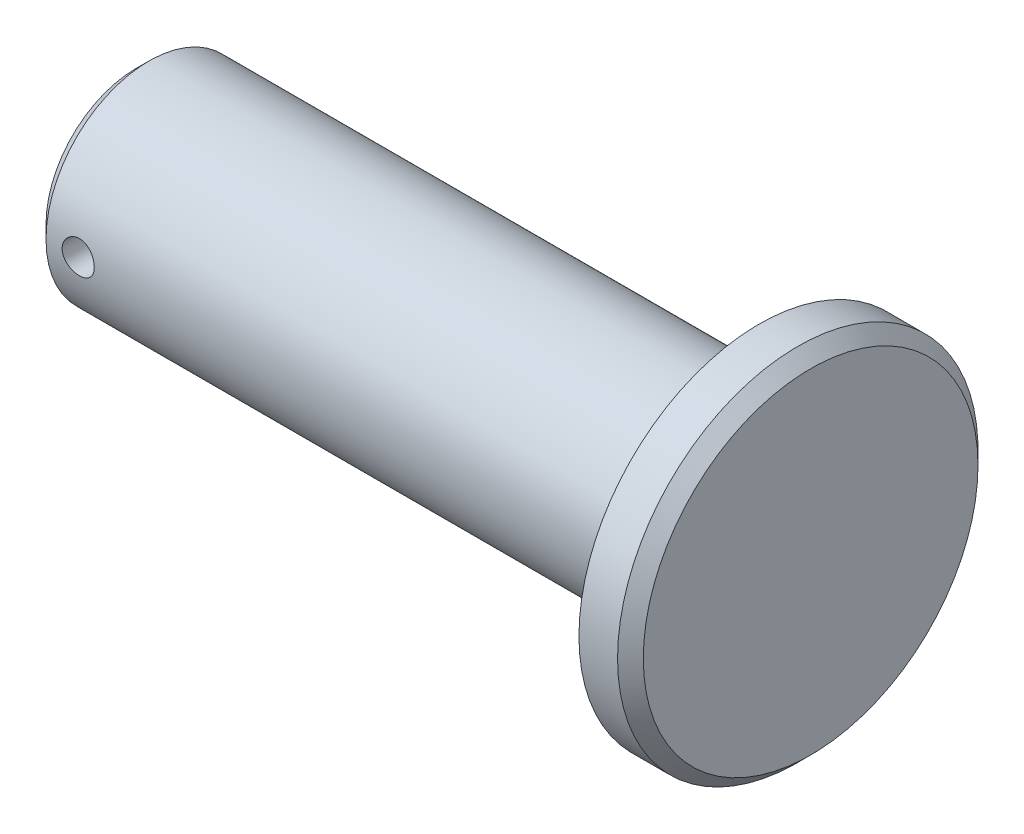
ISO-10303-21;
HEADER;
FILE_DESCRIPTION(('STEP AP214'),'2;1');
FILE_NAME('part.step','',(''),(''),'','','');
FILE_SCHEMA(('AUTOMOTIVE_DESIGN { 1 0 10303 214 1 1 1 1 }'));
ENDSEC;
DATA;
#1=APPLICATION_CONTEXT('core data for automotive mechanical design processes');
#2=APPLICATION_PROTOCOL_DEFINITION('international standard','automotive_design',2000,#1);
#3=PRODUCT_CONTEXT('',#1,'mechanical');
#4=PRODUCT('Part','Part','',(#3));
#5=PRODUCT_RELATED_PRODUCT_CATEGORY('part','',(#4));
#6=PRODUCT_DEFINITION_FORMATION('','',#4);
#7=PRODUCT_DEFINITION_CONTEXT('part definition',#1,'design');
#8=PRODUCT_DEFINITION('design','',#6,#7);
#9=PRODUCT_DEFINITION_SHAPE('','',#8);
#10=(LENGTH_UNIT() NAMED_UNIT(*) SI_UNIT(.MILLI.,.METRE.));
#11=(NAMED_UNIT(*) PLANE_ANGLE_UNIT() SI_UNIT($,.RADIAN.));
#12=(NAMED_UNIT(*) SI_UNIT($,.STERADIAN.) SOLID_ANGLE_UNIT());
#13=UNCERTAINTY_MEASURE_WITH_UNIT(LENGTH_MEASURE(1.E-05),#10,'distance_accuracy_value','');
#14=(GEOMETRIC_REPRESENTATION_CONTEXT(3) GLOBAL_UNCERTAINTY_ASSIGNED_CONTEXT((#13)) GLOBAL_UNIT_ASSIGNED_CONTEXT((#10,
#11,#12)) REPRESENTATION_CONTEXT('',''));
#15=CARTESIAN_POINT('',(0.,0.,0.));
#16=DIRECTION('',(0.,0.,1.));
#17=DIRECTION('',(1.,0.,0.));
#18=AXIS2_PLACEMENT_3D('',#15,#16,#17);
#19=CARTESIAN_POINT('',(-51.4,0.,0.));
#20=DIRECTION('',(1.,0.,0.));
#21=DIRECTION('',(0.,0.,-1.));
#22=AXIS2_PLACEMENT_3D('',#19,#20,#21);
#23=CONICAL_SURFACE('',#22,8.,0.785398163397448);
#24=CARTESIAN_POINT('',(-52.4,0.,0.));
#25=DIRECTION('',(-1.,0.,0.));
#26=DIRECTION('',(0.,0.,1.));
#27=AXIS2_PLACEMENT_3D('',#24,#25,#26);
#28=CIRCLE('',#27,7.);
#29=CARTESIAN_POINT('',(-52.4,0.,7.));
#30=VERTEX_POINT('',#29);
#31=EDGE_CURVE('E86',#30,#30,#28,.T.);
#32=ORIENTED_EDGE('',*,*,#31,.F.);
#33=EDGE_LOOP('',(#32));
#34=FACE_BOUND('',#33,.T.);
#35=CARTESIAN_POINT('',(-51.4,0.,0.));
#36=DIRECTION('',(-1.,0.,0.));
#37=DIRECTION('',(0.,0.,1.));
#38=AXIS2_PLACEMENT_3D('',#35,#36,#37);
#39=CIRCLE('',#38,8.);
#40=CARTESIAN_POINT('',(-51.4,0.,8.));
#41=VERTEX_POINT('',#40);
#42=EDGE_CURVE('E10',#41,#41,#39,.T.);
#43=ORIENTED_EDGE('',*,*,#42,.T.);
#44=EDGE_LOOP('',(#43));
#45=FACE_BOUND('',#44,.T.);
#46=ADVANCED_FACE('F25',(#34,#45),#23,.T.);
#47=CARTESIAN_POINT('',(-61.8887870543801,0.,0.));
#48=DIRECTION('',(-1.,0.,0.));
#49=DIRECTION('',(0.,0.,1.));
#50=AXIS2_PLACEMENT_3D('',#47,#48,#49);
#51=CYLINDRICAL_SURFACE('',#50,8.);
#52=CARTESIAN_POINT('',(-47.65,0.,8.));
#53=CARTESIAN_POINT('',(-47.6500028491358,-0.0697575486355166,7.99999885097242));
#54=CARTESIAN_POINT('',(-47.6558590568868,-0.139554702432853,7.9990780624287));
#55=CARTESIAN_POINT('',(-47.6791218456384,-0.277195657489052,7.99549349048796));
#56=CARTESIAN_POINT('',(-47.6965394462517,-0.34503753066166,7.99282804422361));
#57=CARTESIAN_POINT('',(-47.7423898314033,-0.476756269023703,7.98605348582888));
#58=CARTESIAN_POINT('',(-47.7708140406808,-0.540636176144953,7.98194549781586));
#59=CARTESIAN_POINT('',(-47.8378492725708,-0.662710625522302,7.97273897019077));
#60=CARTESIAN_POINT('',(-47.876458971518,-0.720905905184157,7.96764055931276));
#61=CARTESIAN_POINT('',(-47.963116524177,-0.830459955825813,7.95697134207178));
#62=CARTESIAN_POINT('',(-48.0112334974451,-0.881763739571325,7.95139725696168));
#63=CARTESIAN_POINT('',(-48.1153909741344,-0.975603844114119,7.94043038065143));
#64=CARTESIAN_POINT('',(-48.1714319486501,-1.01813964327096,7.93503760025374));
#65=CARTESIAN_POINT('',(-48.2902191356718,-1.09345272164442,7.92501214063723));
#66=CARTESIAN_POINT('',(-48.3529997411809,-1.12617636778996,7.92038369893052));
#67=CARTESIAN_POINT('',(-48.4832507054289,-1.18059340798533,7.91245600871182));
#68=CARTESIAN_POINT('',(-48.5507207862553,-1.20228745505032,7.90915668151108));
#69=CARTESIAN_POINT('',(-48.6878554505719,-1.23385779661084,7.90429317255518));
#70=CARTESIAN_POINT('',(-48.7574977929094,-1.24382852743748,7.90271513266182));
#71=CARTESIAN_POINT('',(-48.8974835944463,-1.25196184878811,7.90143085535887));
#72=CARTESIAN_POINT('',(-48.967827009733,-1.25012517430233,7.90172450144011));
#73=CARTESIAN_POINT('',(-49.1065485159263,-1.23477290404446,7.90413775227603));
#74=CARTESIAN_POINT('',(-49.1749386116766,-1.22136281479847,7.90624086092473));
#75=CARTESIAN_POINT('',(-49.3084860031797,-1.18340968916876,7.91201028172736));
#76=CARTESIAN_POINT('',(-49.3736432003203,-1.15886631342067,7.91567664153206));
#77=CARTESIAN_POINT('',(-49.4991943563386,-1.09923458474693,7.92417753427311));
#78=CARTESIAN_POINT('',(-49.5595668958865,-1.06410186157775,7.92901696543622));
#79=CARTESIAN_POINT('',(-49.6735997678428,-0.984320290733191,7.93931523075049));
#80=CARTESIAN_POINT('',(-49.7272596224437,-0.939670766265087,7.94477410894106));
#81=CARTESIAN_POINT('',(-49.8269551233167,-0.841545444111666,7.95576893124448));
#82=CARTESIAN_POINT('',(-49.8729015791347,-0.787979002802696,7.96130506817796));
#83=CARTESIAN_POINT('',(-49.9551665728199,-0.673848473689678,7.97177562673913));
#84=CARTESIAN_POINT('',(-49.9914850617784,-0.613284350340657,7.97671004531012));
#85=CARTESIAN_POINT('',(-50.0534690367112,-0.486797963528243,7.98542699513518));
#86=CARTESIAN_POINT('',(-50.0791272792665,-0.420872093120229,7.98920874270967));
#87=CARTESIAN_POINT('',(-50.1189829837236,-0.285574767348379,7.99518780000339));
#88=CARTESIAN_POINT('',(-50.1331812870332,-0.2162035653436,7.99738522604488));
#89=CARTESIAN_POINT('',(-50.1495946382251,-0.0767541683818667,7.99993255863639));
#90=CARTESIAN_POINT('',(-50.1519322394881,-0.00669073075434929,8.0003013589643));
#91=CARTESIAN_POINT('',(-50.144883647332,0.132827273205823,7.99920143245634));
#92=CARTESIAN_POINT('',(-50.1354978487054,0.202281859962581,7.99773276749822));
#93=CARTESIAN_POINT('',(-50.1053708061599,0.338236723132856,7.99313461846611));
#94=CARTESIAN_POINT('',(-50.0846896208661,0.404750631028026,7.99001392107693));
#95=CARTESIAN_POINT('',(-50.0326224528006,0.533367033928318,7.98246037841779));
#96=CARTESIAN_POINT('',(-50.0012359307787,0.595469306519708,7.97802746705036));
#97=CARTESIAN_POINT('',(-49.9283640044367,0.714036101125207,7.96829486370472));
#98=CARTESIAN_POINT('',(-49.8868012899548,0.770452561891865,7.9629886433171));
#99=CARTESIAN_POINT('',(-49.7948639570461,0.875553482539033,7.95211940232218));
#100=CARTESIAN_POINT('',(-49.7444887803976,0.924237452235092,7.94655636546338));
#101=CARTESIAN_POINT('',(-49.6358094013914,1.01294040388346,7.93574013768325));
#102=CARTESIAN_POINT('',(-49.5774375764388,1.05287699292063,7.93049020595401));
#103=CARTESIAN_POINT('',(-49.4547419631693,1.12237783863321,7.92095346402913));
#104=CARTESIAN_POINT('',(-49.3904183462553,1.15194239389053,7.91666662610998));
#105=CARTESIAN_POINT('',(-49.2578851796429,1.19973385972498,7.90956535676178));
#106=CARTESIAN_POINT('',(-49.1896912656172,1.21800327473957,7.9067454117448));
#107=CARTESIAN_POINT('',(-49.051155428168,1.24282061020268,7.90288285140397));
#108=CARTESIAN_POINT('',(-48.9808136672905,1.24936941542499,7.9018401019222));
#109=CARTESIAN_POINT('',(-48.8408006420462,1.25053726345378,7.90165529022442));
#110=CARTESIAN_POINT('',(-48.7711304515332,1.24528590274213,7.90249258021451));
#111=CARTESIAN_POINT('',(-48.6336773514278,1.22328111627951,7.90592849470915));
#112=CARTESIAN_POINT('',(-48.5658944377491,1.20652771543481,7.90852711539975));
#113=CARTESIAN_POINT('',(-48.4341810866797,1.16204164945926,7.91518544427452));
#114=CARTESIAN_POINT('',(-48.3702472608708,1.13431880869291,7.91924384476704));
#115=CARTESIAN_POINT('',(-48.2479171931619,1.06869384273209,7.92836592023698));
#116=CARTESIAN_POINT('',(-48.1895211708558,1.03079131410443,7.93342963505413));
#117=CARTESIAN_POINT('',(-48.0792672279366,0.945415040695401,7.9440578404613));
#118=CARTESIAN_POINT('',(-48.0274839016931,0.897845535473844,7.94962700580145));
#119=CARTESIAN_POINT('',(-47.9325893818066,0.794687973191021,7.96060021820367));
#120=CARTESIAN_POINT('',(-47.889480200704,0.739098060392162,7.96600422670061));
#121=CARTESIAN_POINT('',(-47.8129243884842,0.621083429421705,7.9760755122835));
#122=CARTESIAN_POINT('',(-47.7795373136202,0.558619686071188,7.98073817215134));
#123=CARTESIAN_POINT('',(-47.7237795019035,0.428925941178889,7.98875629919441));
#124=CARTESIAN_POINT('',(-47.7013975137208,0.361700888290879,7.9921131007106));
#125=CARTESIAN_POINT('',(-47.6732834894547,0.245157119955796,7.9963872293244));
#126=CARTESIAN_POINT('',(-47.6645657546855,0.196552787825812,7.99773495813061));
#127=CARTESIAN_POINT('',(-47.6529230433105,0.098638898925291,7.99954174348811));
#128=CARTESIAN_POINT('',(-47.6499979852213,0.0493293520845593,8.00000081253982));
#129=CARTESIAN_POINT('',(-47.65,0.,8.));
#130=B_SPLINE_CURVE_WITH_KNOTS('',3,(#52,#53,#54,#55,#56,#57,#58,#59,#60,#61,#62,#63,#64,#65,
#66,#67,#68,#69,#70,#71,#72,#73,#74,#75,#76,#77,#78,#79,#80,#81,#82,#83,#84,#85,#86,#87,#88,#89,
#90,#91,#92,#93,#94,#95,#96,#97,#98,#99,#100,#101,#102,#103,#104,#105,#106,#107,#108,#109,#110,
#111,#112,#113,#114,#115,#116,#117,#118,#119,#120,#121,#122,#123,#124,#125,#126,#127,#128,#129),
.UNSPECIFIED.,.T.,.F.,(4,2,2,2,2,2,2,2,2,2,2,2,2,2,2,2,2,2,2,2,2,2,2,2,2,2,2,2,2,2,2,2,2,2,2,2,
2,2,4),(0.,0.209092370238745,0.418384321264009,0.627513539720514,0.836615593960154,
1.047297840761,1.25799261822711,1.46981889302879,1.6816326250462,1.89172815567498,
2.10181060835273,2.3099978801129,2.51819149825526,2.72726988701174,2.93636314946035,
3.14772866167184,3.35909524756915,3.57060521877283,3.78209965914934,3.99140427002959,
4.2007018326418,4.40889722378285,4.61710310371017,4.82694270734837,5.03679560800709,
5.24854740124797,5.46029309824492,5.67123705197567,5.8821650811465,6.09078790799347,
6.2994102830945,6.50784623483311,6.71629044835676,6.92691006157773,7.13757848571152,
7.34951152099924,7.56122742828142,7.70909008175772,7.85695065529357),.UNSPECIFIED.);
#131=CARTESIAN_POINT('',(-47.65,0.,8.));
#132=VERTEX_POINT('',#131);
#133=EDGE_CURVE('E28',#132,#132,#130,.T.);
#134=ORIENTED_EDGE('',*,*,#133,.T.);
#135=EDGE_LOOP('',(#134));
#136=FACE_BOUND('',#135,.T.);
#137=CARTESIAN_POINT('',(-47.65,0.,-8.));
#138=CARTESIAN_POINT('',(-47.6500028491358,0.0697575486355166,-7.99999885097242));
#139=CARTESIAN_POINT('',(-47.6558590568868,0.139554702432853,-7.9990780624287));
#140=CARTESIAN_POINT('',(-47.6791218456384,0.277195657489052,-7.99549349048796));
#141=CARTESIAN_POINT('',(-47.6965394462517,0.34503753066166,-7.99282804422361));
#142=CARTESIAN_POINT('',(-47.7423898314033,0.476756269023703,-7.98605348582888));
#143=CARTESIAN_POINT('',(-47.7708140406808,0.540636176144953,-7.98194549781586));
#144=CARTESIAN_POINT('',(-47.8378492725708,0.662710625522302,-7.97273897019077));
#145=CARTESIAN_POINT('',(-47.876458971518,0.720905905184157,-7.96764055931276));
#146=CARTESIAN_POINT('',(-47.963116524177,0.830459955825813,-7.95697134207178));
#147=CARTESIAN_POINT('',(-48.0112334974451,0.881763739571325,-7.95139725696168));
#148=CARTESIAN_POINT('',(-48.1153909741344,0.975603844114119,-7.94043038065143));
#149=CARTESIAN_POINT('',(-48.1714319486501,1.01813964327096,-7.93503760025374));
#150=CARTESIAN_POINT('',(-48.2902191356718,1.09345272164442,-7.92501214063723));
#151=CARTESIAN_POINT('',(-48.3529997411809,1.12617636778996,-7.92038369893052));
#152=CARTESIAN_POINT('',(-48.4832507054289,1.18059340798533,-7.91245600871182));
#153=CARTESIAN_POINT('',(-48.5507207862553,1.20228745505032,-7.90915668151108));
#154=CARTESIAN_POINT('',(-48.6878554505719,1.23385779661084,-7.90429317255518));
#155=CARTESIAN_POINT('',(-48.7574977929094,1.24382852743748,-7.90271513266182));
#156=CARTESIAN_POINT('',(-48.8974835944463,1.25196184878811,-7.90143085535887));
#157=CARTESIAN_POINT('',(-48.967827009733,1.25012517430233,-7.90172450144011));
#158=CARTESIAN_POINT('',(-49.1065485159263,1.23477290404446,-7.90413775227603));
#159=CARTESIAN_POINT('',(-49.1749386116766,1.22136281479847,-7.90624086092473));
#160=CARTESIAN_POINT('',(-49.3084860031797,1.18340968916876,-7.91201028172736));
#161=CARTESIAN_POINT('',(-49.3736432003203,1.15886631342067,-7.91567664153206));
#162=CARTESIAN_POINT('',(-49.4991943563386,1.09923458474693,-7.92417753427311));
#163=CARTESIAN_POINT('',(-49.5595668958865,1.06410186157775,-7.92901696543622));
#164=CARTESIAN_POINT('',(-49.6735997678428,0.984320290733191,-7.93931523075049));
#165=CARTESIAN_POINT('',(-49.7272596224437,0.939670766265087,-7.94477410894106));
#166=CARTESIAN_POINT('',(-49.8269551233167,0.841545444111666,-7.95576893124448));
#167=CARTESIAN_POINT('',(-49.8729015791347,0.787979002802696,-7.96130506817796));
#168=CARTESIAN_POINT('',(-49.9551665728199,0.673848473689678,-7.97177562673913));
#169=CARTESIAN_POINT('',(-49.9914850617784,0.613284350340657,-7.97671004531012));
#170=CARTESIAN_POINT('',(-50.0534690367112,0.486797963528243,-7.98542699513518));
#171=CARTESIAN_POINT('',(-50.0791272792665,0.420872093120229,-7.98920874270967));
#172=CARTESIAN_POINT('',(-50.1189829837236,0.285574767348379,-7.99518780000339));
#173=CARTESIAN_POINT('',(-50.1331812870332,0.2162035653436,-7.99738522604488));
#174=CARTESIAN_POINT('',(-50.1495946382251,0.0767541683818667,-7.99993255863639));
#175=CARTESIAN_POINT('',(-50.1519322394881,0.00669073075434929,-8.0003013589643));
#176=CARTESIAN_POINT('',(-50.144883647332,-0.132827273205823,-7.99920143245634));
#177=CARTESIAN_POINT('',(-50.1354978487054,-0.202281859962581,-7.99773276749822));
#178=CARTESIAN_POINT('',(-50.1053708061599,-0.338236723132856,-7.99313461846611));
#179=CARTESIAN_POINT('',(-50.0846896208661,-0.404750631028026,-7.99001392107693));
#180=CARTESIAN_POINT('',(-50.0326224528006,-0.533367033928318,-7.98246037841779));
#181=CARTESIAN_POINT('',(-50.0012359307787,-0.595469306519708,-7.97802746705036));
#182=CARTESIAN_POINT('',(-49.9283640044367,-0.714036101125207,-7.96829486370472));
#183=CARTESIAN_POINT('',(-49.8868012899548,-0.770452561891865,-7.9629886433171));
#184=CARTESIAN_POINT('',(-49.7948639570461,-0.875553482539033,-7.95211940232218));
#185=CARTESIAN_POINT('',(-49.7444887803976,-0.924237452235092,-7.94655636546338));
#186=CARTESIAN_POINT('',(-49.6358094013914,-1.01294040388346,-7.93574013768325));
#187=CARTESIAN_POINT('',(-49.5774375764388,-1.05287699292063,-7.93049020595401));
#188=CARTESIAN_POINT('',(-49.4547419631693,-1.12237783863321,-7.92095346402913));
#189=CARTESIAN_POINT('',(-49.3904183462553,-1.15194239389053,-7.91666662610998));
#190=CARTESIAN_POINT('',(-49.2578851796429,-1.19973385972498,-7.90956535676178));
#191=CARTESIAN_POINT('',(-49.1896912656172,-1.21800327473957,-7.9067454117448));
#192=CARTESIAN_POINT('',(-49.051155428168,-1.24282061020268,-7.90288285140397));
#193=CARTESIAN_POINT('',(-48.9808136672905,-1.24936941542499,-7.9018401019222));
#194=CARTESIAN_POINT('',(-48.8408006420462,-1.25053726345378,-7.90165529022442));
#195=CARTESIAN_POINT('',(-48.7711304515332,-1.24528590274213,-7.90249258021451));
#196=CARTESIAN_POINT('',(-48.6336773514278,-1.22328111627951,-7.90592849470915));
#197=CARTESIAN_POINT('',(-48.5658944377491,-1.20652771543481,-7.90852711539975));
#198=CARTESIAN_POINT('',(-48.4341810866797,-1.16204164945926,-7.91518544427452));
#199=CARTESIAN_POINT('',(-48.3702472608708,-1.13431880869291,-7.91924384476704));
#200=CARTESIAN_POINT('',(-48.2479171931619,-1.06869384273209,-7.92836592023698));
#201=CARTESIAN_POINT('',(-48.1895211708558,-1.03079131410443,-7.93342963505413));
#202=CARTESIAN_POINT('',(-48.0792672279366,-0.945415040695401,-7.9440578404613));
#203=CARTESIAN_POINT('',(-48.0274839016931,-0.897845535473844,-7.94962700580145));
#204=CARTESIAN_POINT('',(-47.9325893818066,-0.794687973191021,-7.96060021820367));
#205=CARTESIAN_POINT('',(-47.889480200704,-0.739098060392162,-7.96600422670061));
#206=CARTESIAN_POINT('',(-47.8129243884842,-0.621083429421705,-7.9760755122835));
#207=CARTESIAN_POINT('',(-47.7795373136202,-0.558619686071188,-7.98073817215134));
#208=CARTESIAN_POINT('',(-47.7237795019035,-0.428925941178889,-7.98875629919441));
#209=CARTESIAN_POINT('',(-47.7013975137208,-0.361700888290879,-7.9921131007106));
#210=CARTESIAN_POINT('',(-47.6732834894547,-0.245157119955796,-7.9963872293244));
#211=CARTESIAN_POINT('',(-47.6645657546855,-0.196552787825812,-7.99773495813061));
#212=CARTESIAN_POINT('',(-47.6529230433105,-0.098638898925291,-7.99954174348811));
#213=CARTESIAN_POINT('',(-47.6499979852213,-0.0493293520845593,-8.00000081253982));
#214=CARTESIAN_POINT('',(-47.65,0.,-8.));
#215=B_SPLINE_CURVE_WITH_KNOTS('',3,(#137,#138,#139,#140,#141,#142,#143,#144,#145,#146,#147,
#148,#149,#150,#151,#152,#153,#154,#155,#156,#157,#158,#159,#160,#161,#162,#163,#164,#165,#166,
#167,#168,#169,#170,#171,#172,#173,#174,#175,#176,#177,#178,#179,#180,#181,#182,#183,#184,#185,
#186,#187,#188,#189,#190,#191,#192,#193,#194,#195,#196,#197,#198,#199,#200,#201,#202,#203,#204,
#205,#206,#207,#208,#209,#210,#211,#212,#213,#214),.UNSPECIFIED.,.T.,.F.,(4,2,2,2,2,2,2,2,2,2,2,
2,2,2,2,2,2,2,2,2,2,2,2,2,2,2,2,2,2,2,2,2,2,2,2,2,2,2,4),(0.,0.209092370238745,
0.418384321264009,0.627513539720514,0.836615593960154,1.047297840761,1.25799261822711,
1.46981889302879,1.6816326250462,1.89172815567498,2.10181060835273,2.3099978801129,
2.51819149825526,2.72726988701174,2.93636314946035,3.14772866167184,3.35909524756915,
3.57060521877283,3.78209965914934,3.99140427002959,4.2007018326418,4.40889722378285,
4.61710310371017,4.82694270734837,5.03679560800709,5.24854740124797,5.46029309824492,
5.67123705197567,5.8821650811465,6.09078790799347,6.2994102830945,6.50784623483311,
6.71629044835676,6.92691006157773,7.13757848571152,7.34951152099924,7.56122742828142,
7.70909008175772,7.85695065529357),.UNSPECIFIED.);
#216=CARTESIAN_POINT('',(-47.65,0.,-8.));
#217=VERTEX_POINT('',#216);
#218=EDGE_CURVE('E43',#217,#217,#215,.T.);
#219=ORIENTED_EDGE('',*,*,#218,.T.);
#220=EDGE_LOOP('',(#219));
#221=FACE_BOUND('',#220,.T.);
#222=ORIENTED_EDGE('',*,*,#42,.F.);
#223=EDGE_LOOP('',(#222));
#224=FACE_BOUND('',#223,.T.);
#225=CARTESIAN_POINT('',(-4.,0.,0.));
#226=DIRECTION('',(-1.,0.,0.));
#227=DIRECTION('',(0.,0.,1.));
#228=AXIS2_PLACEMENT_3D('',#225,#226,#227);
#229=CIRCLE('',#228,8.);
#230=CARTESIAN_POINT('',(-4.,0.,8.));
#231=VERTEX_POINT('',#230);
#232=EDGE_CURVE('E35',#231,#231,#229,.T.);
#233=ORIENTED_EDGE('',*,*,#232,.T.);
#234=EDGE_LOOP('',(#233));
#235=FACE_BOUND('',#234,.T.);
#236=ADVANCED_FACE('F47',(#136,#221,#224,#235),#51,.T.);
#237=CARTESIAN_POINT('',(-4.,8.,0.));
#238=DIRECTION('',(1.,0.,0.));
#239=DIRECTION('',(0.,0.,-1.));
#240=AXIS2_PLACEMENT_3D('',#237,#238,#239);
#241=PLANE('',#240);
#242=ORIENTED_EDGE('',*,*,#232,.F.);
#243=EDGE_LOOP('',(#242));
#244=FACE_BOUND('',#243,.T.);
#245=CARTESIAN_POINT('',(-4.,0.,0.));
#246=DIRECTION('',(-1.,0.,0.));
#247=DIRECTION('',(0.,0.,1.));
#248=AXIS2_PLACEMENT_3D('',#245,#246,#247);
#249=CIRCLE('',#248,14.);
#250=CARTESIAN_POINT('',(-4.,0.,14.));
#251=VERTEX_POINT('',#250);
#252=EDGE_CURVE('E40',#251,#251,#249,.T.);
#253=ORIENTED_EDGE('',*,*,#252,.T.);
#254=EDGE_LOOP('',(#253));
#255=FACE_BOUND('',#254,.T.);
#256=ADVANCED_FACE('F70',(#244,#255),#241,.F.);
#257=CARTESIAN_POINT('',(-61.8887870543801,0.,0.));
#258=DIRECTION('',(-1.,0.,0.));
#259=DIRECTION('',(0.,0.,1.));
#260=AXIS2_PLACEMENT_3D('',#257,#258,#259);
#261=CYLINDRICAL_SURFACE('',#260,14.);
#262=ORIENTED_EDGE('',*,*,#252,.F.);
#263=EDGE_LOOP('',(#262));
#264=FACE_BOUND('',#263,.T.);
#265=CARTESIAN_POINT('',(-1.,0.,0.));
#266=DIRECTION('',(-1.,0.,0.));
#267=DIRECTION('',(0.,0.,1.));
#268=AXIS2_PLACEMENT_3D('',#265,#266,#267);
#269=CIRCLE('',#268,14.);
#270=CARTESIAN_POINT('',(-1.,0.,14.));
#271=VERTEX_POINT('',#270);
#272=EDGE_CURVE('E90',#271,#271,#269,.T.);
#273=ORIENTED_EDGE('',*,*,#272,.T.);
#274=EDGE_LOOP('',(#273));
#275=FACE_BOUND('',#274,.T.);
#276=ADVANCED_FACE('F67',(#264,#275),#261,.T.);
#277=CARTESIAN_POINT('',(0.,0.,0.));
#278=DIRECTION('',(-1.,0.,0.));
#279=DIRECTION('',(0.,0.,1.));
#280=AXIS2_PLACEMENT_3D('',#277,#278,#279);
#281=CONICAL_SURFACE('',#280,13.,0.785398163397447);
#282=ORIENTED_EDGE('',*,*,#272,.F.);
#283=EDGE_LOOP('',(#282));
#284=FACE_BOUND('',#283,.T.);
#285=CARTESIAN_POINT('',(0.,0.,0.));
#286=DIRECTION('',(-1.,0.,0.));
#287=DIRECTION('',(0.,0.,1.));
#288=AXIS2_PLACEMENT_3D('',#285,#286,#287);
#289=CIRCLE('',#288,13.);
#290=CARTESIAN_POINT('',(0.,0.,13.));
#291=VERTEX_POINT('',#290);
#292=EDGE_CURVE('E87',#291,#291,#289,.T.);
#293=ORIENTED_EDGE('',*,*,#292,.T.);
#294=EDGE_LOOP('',(#293));
#295=FACE_BOUND('',#294,.T.);
#296=ADVANCED_FACE('F63',(#284,#295),#281,.T.);
#297=CARTESIAN_POINT('',(0.,13.,0.));
#298=DIRECTION('',(-1.,0.,0.));
#299=DIRECTION('',(0.,0.,1.));
#300=AXIS2_PLACEMENT_3D('',#297,#298,#299);
#301=PLANE('',#300);
#302=ORIENTED_EDGE('',*,*,#292,.F.);
#303=EDGE_LOOP('',(#302));
#304=FACE_BOUND('',#303,.T.);
#305=ADVANCED_FACE('F59',(#304),#301,.F.);
#306=CARTESIAN_POINT('',(-52.4,0.,0.));
#307=DIRECTION('',(1.,0.,0.));
#308=DIRECTION('',(0.,0.,-1.));
#309=AXIS2_PLACEMENT_3D('',#306,#307,#308);
#310=PLANE('',#309);
#311=ORIENTED_EDGE('',*,*,#31,.T.);
#312=EDGE_LOOP('',(#311));
#313=FACE_BOUND('',#312,.T.);
#314=ADVANCED_FACE('F54',(#313),#310,.F.);
#315=CARTESIAN_POINT('',(-48.9,0.,-10.));
#316=DIRECTION('',(0.,0.,1.));
#317=DIRECTION('',(1.,0.,0.));
#318=AXIS2_PLACEMENT_3D('',#315,#316,#317);
#319=CYLINDRICAL_SURFACE('',#318,1.25);
#320=ORIENTED_EDGE('',*,*,#218,.F.);
#321=EDGE_LOOP('',(#320));
#322=FACE_BOUND('',#321,.T.);
#323=ORIENTED_EDGE('',*,*,#133,.F.);
#324=EDGE_LOOP('',(#323));
#325=FACE_BOUND('',#324,.T.);
#326=ADVANCED_FACE('F50',(#322,#325),#319,.F.);
#327=CLOSED_SHELL('',(#46,#236,#256,#276,#296,#305,#314,#326));
#328=MANIFOLD_SOLID_BREP('B2',#327);
#329=ADVANCED_BREP_SHAPE_REPRESENTATION('',(#18,#328),#14);
#330=SHAPE_DEFINITION_REPRESENTATION(#9,#329);
ENDSEC;
END-ISO-10303-21;
